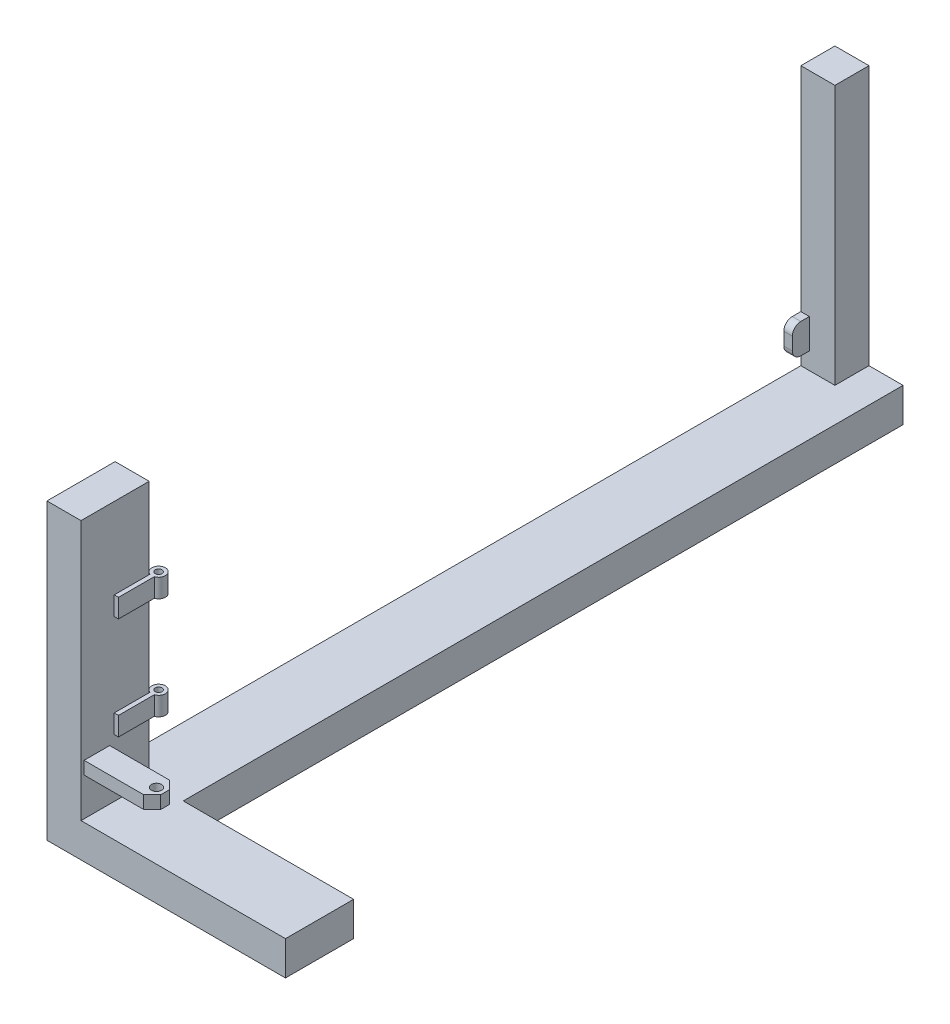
from build123d import *

# Parameters (mm, degrees)
ESQUISSE1_W             = 80
ESQUISSE1_H             = 40
BASE_EXTRUSION_DEPTH    = 925
ESQUISSE2_W             = 80
ESQUISSE2_H             = 40
BOSS_EXTRU_1_DEPTH      = 200
ESQUISSE3_W             = 40
ESQUISSE3_H             = 80
BOSS_EXTRU_2_DEPTH      = 305
ESQUISSE4_W             = 40
ESQUISSE4_H             = 40
BOSS_EXTRU_3_DEPTH      = 305
ESQUISSE5_W             = 42
ESQUISSE5_H             = 22
BOSS_EXTRU_4_DEPTH      = 5
ESQUISSE6_R             = 8
ESQUISSE6_R_2           = 4
BOSS_EXTRU_5_DEPTH      = 22
ESQUISSE8_R             = 8
ESQUISSE8_R_2           = 4
BOSS_EXTRU_7_DEPTH      = 22
ESQUISSE9_W             = 10
ESQUISSE9_H             = 35
BOSS_EXTRU_8_DEPTH      = 20
CONG_1_R                = 10
ESQUISSE10_W            = 30
ESQUISSE10_H            = 15
BOSS_EXTRU_9_DEPTH      = 80
ENL_V_MAT_EXTRU_1_REACH = 999.144
ESQUISSE11_R            = 6
CHANFREIN1_SIZE         = 10


with BuildPart() as part:
    # Esquisse1 → Base-Extrusion (new body)
    with BuildSketch(Plane.XY):
        with Locations((40, 20)):
            Rectangle(ESQUISSE1_W, ESQUISSE1_H)
    extrude(amount=BASE_EXTRUSION_DEPTH)

    # Esquisse2 → Boss.-Extru.1 (add)
    with BuildSketch(Plane(origin=(80, 0, 0), x_dir=(0, 0, -1), z_dir=(1, 0, 0))):
        with Locations((-885, 20)):
            Rectangle(ESQUISSE2_W, ESQUISSE2_H)
    extrude(amount=BOSS_EXTRU_1_DEPTH)

    # Esquisse3 → Boss.-Extru.2 (add)
    with BuildSketch(Plane(origin=(0, 40, 0), x_dir=(-1, 0, 0), z_dir=(0, 1, 0))):
        with Locations((-20, 885)):
            Rectangle(ESQUISSE3_W, ESQUISSE3_H)
    extrude(amount=BOSS_EXTRU_2_DEPTH)

    # Esquisse4 → Boss.-Extru.3 (add)
    with BuildSketch(Plane(origin=(0, 40, 0), x_dir=(-1, 0, 0), z_dir=(0, 1, 0))):
        with Locations((-20, 20)):
            Rectangle(ESQUISSE4_W, ESQUISSE4_H)
    extrude(amount=BOSS_EXTRU_3_DEPTH)

    # Esquisse5 → Boss.-Extru.4 (add)
    with BuildSketch(Plane(origin=(40, 0, 0), x_dir=(0, 0, -1), z_dir=(1, 0, 0))):
        with Locations((-865, 119)):
            Rectangle(ESQUISSE5_W, ESQUISSE5_H)
        with Locations((-865, 239)):
            Rectangle(ESQUISSE5_W, ESQUISSE5_H)
    extrude(amount=BOSS_EXTRU_4_DEPTH)

    # Esquisse6 → Boss.-Extru.5 (add)
    with BuildSketch(Plane(origin=(0, 250, 0), x_dir=(-1, 0, 0), z_dir=(0, 1, 0))):
        with Locations((-42.5, 836.400657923)):
            Circle(ESQUISSE6_R)
        with Locations((-42.5, 836.400657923)):
            Circle(ESQUISSE6_R_2, mode=Mode.SUBTRACT)
    extrude(amount=-BOSS_EXTRU_5_DEPTH)

    # Esquisse8 → Boss.-Extru.7 (add)
    with BuildSketch(Plane(origin=(0, 130, 0), x_dir=(-1, 0, 0), z_dir=(0, 1, 0))):
        with Locations((-42.5, 836.400657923)):
            Circle(ESQUISSE8_R)
        with Locations((-42.5, 836.400657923)):
            Circle(ESQUISSE8_R_2, mode=Mode.SUBTRACT)
    extrude(amount=-BOSS_EXTRU_7_DEPTH)

    # Esquisse9 → Boss.-Extru.8 (add)
    with BuildSketch(Plane.XY.offset(40)):
        with Locations((5, 77.5)):
            Rectangle(ESQUISSE9_W, ESQUISSE9_H)
    extrude(amount=BOSS_EXTRU_8_DEPTH)

    # Cong_1
    cong_1_edges = [part.edges().sort_by_distance(p)[0] for p in [
        (5, 60, 60),
        (5, 95, 60),
    ]]
    fillet(cong_1_edges, radius=CONG_1_R)

    # Esquisse10 → Boss.-Extru.9 (add)
    with BuildSketch(Plane(origin=(40, 0, 0), x_dir=(0, 0, -1), z_dir=(1, 0, 0))):
        with Locations((-906.400657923, 92)):
            Rectangle(ESQUISSE10_W, ESQUISSE10_H)
    extrude(amount=BOSS_EXTRU_9_DEPTH)

    # Esquisse11 → Enl_v. mat.-Extru.1 (cut, up to next)
    with BuildSketch(Plane(origin=(0, 99.5, 0), x_dir=(-1, 0, 0), z_dir=(0, 1, 0)), mode=Mode.PRIVATE) as enl_v_mat_extru_1_sk1:
        with Locations((-110, 906.400657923)):
            Circle(ESQUISSE11_R)
    enl_v_mat_extru_1_tool1 = extrude(enl_v_mat_extru_1_sk1.sketch, amount=-ENL_V_MAT_EXTRU_1_REACH, mode=Mode.PRIVATE) & part.part
    add(enl_v_mat_extru_1_tool1.solids().sort_by_distance((110, 99.5, 906.400658))[0], mode=Mode.SUBTRACT)

    # Chanfrein1
    chanfrein1_edges = [part.edges().sort_by_distance(p)[0] for p in [
        (120, 92, 921.400657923),
        (120, 92, 891.400657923),
    ]]
    chamfer(chanfrein1_edges, length=CHANFREIN1_SIZE)


solid = part.part
